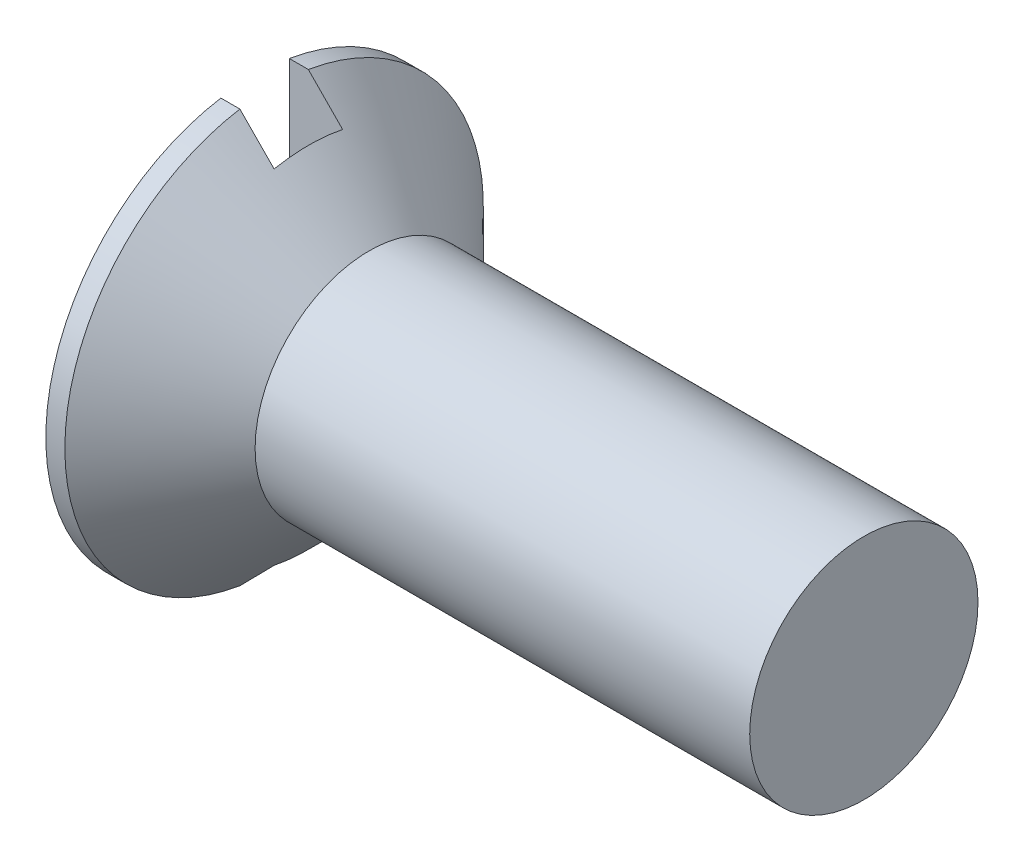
from build123d import *

# Parameters (mm, degrees)
SLOT_START = -1.4
SLOT_DEPTH = 1.4


with BuildPart() as part:
    # BodySke → Base-Revolve (revolve)
    with BuildSketch(Plane.XY, mode=Mode.PRIVATE) as base_revolve_sk:
        Polygon((0, 0), (0, 5.5), (0.5, 5.5), (3, 3), (16, 3), (16, 0), align=None)
    revolve(base_revolve_sk.sketch.rotate(Axis((-6.35, 0, 0), (1, 0, 0)), 90), axis=Axis((-6.35, 0, 0), (1, 0, 0)))

    # Sketch5 → Slot (cut)
    with BuildSketch(Plane(origin=(0, 4.164515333, -0.717327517), x_dir=(0, 0, 1), z_dir=(-1, 0, 0)).offset(SLOT_START)):
        with BuildLine():
            Line((1.617327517, 1.261348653), (1.617327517, -9.59037932))
            ThreePointArc((1.617327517, -9.59037932), (0.717327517, -9.664515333), (-0.182672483, -9.59037932))
            Line((-0.182672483, -9.59037932), (-0.182672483, 1.261348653))
            ThreePointArc((-0.182672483, 1.261348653), (0.717327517, 1.335484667), (1.617327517, 1.261348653))
        make_face()
    extrude(amount=SLOT_DEPTH, mode=Mode.SUBTRACT)


solid = part.part
